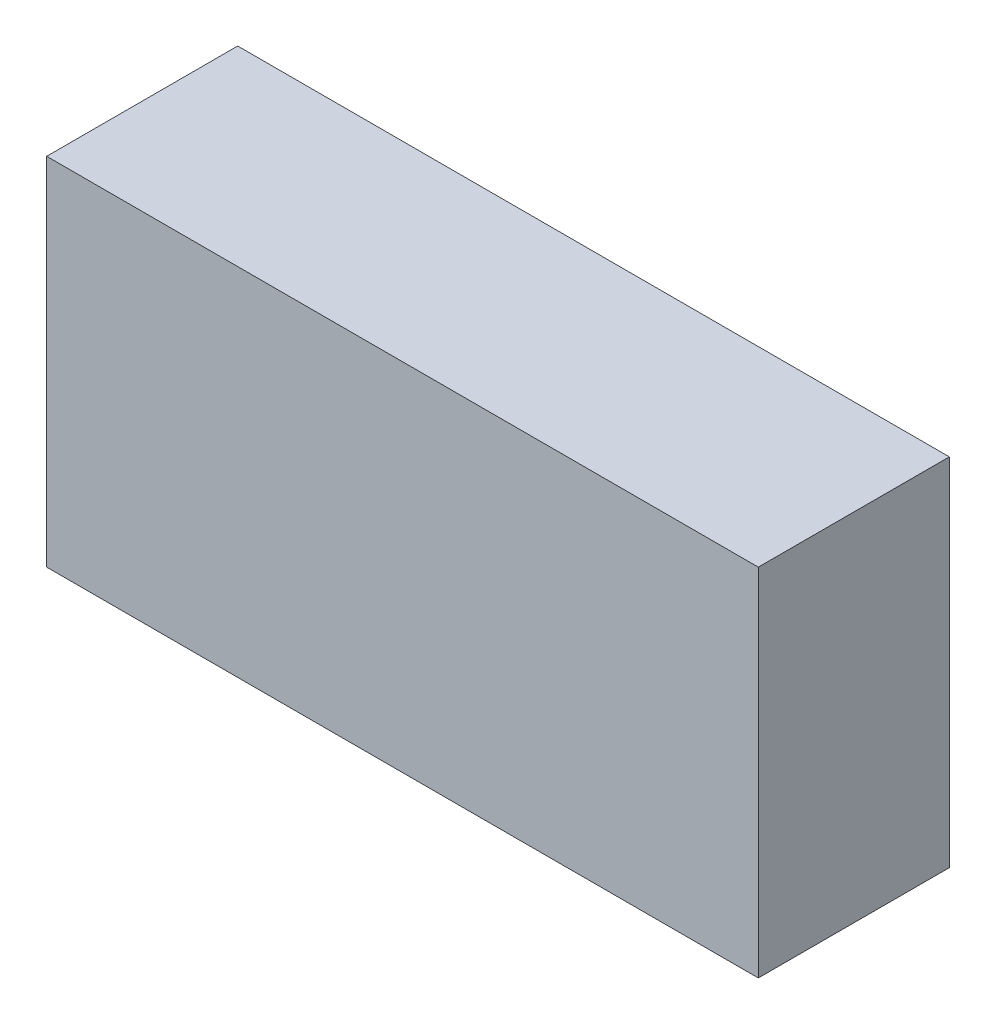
from build123d import *

# Parameters (mm, degrees)
COMPONENT_OUTLINE_W = 1.1176
COMPONENT_OUTLINE_H = 0.5588
BOSS_EXTRUDE1_DEPTH = 0.3


with BuildPart() as part:
    # Component_Outline → Boss-Extrude1 (new body)
    with BuildSketch(Plane.XY):
        Rectangle(COMPONENT_OUTLINE_W, COMPONENT_OUTLINE_H)
    extrude(amount=BOSS_EXTRUDE1_DEPTH)


solid = part.part
